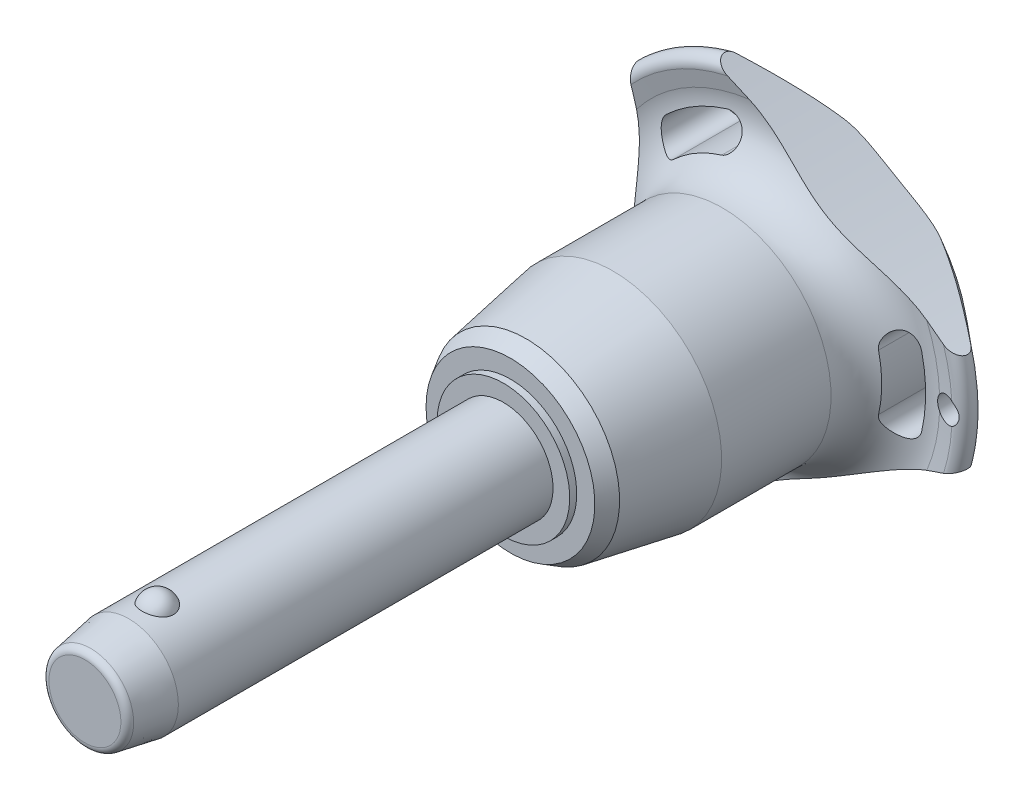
from build123d import *

# Parameters (mm, degrees)
SKETCH1_R           = 6
BOSS_EXTRUDE1_DEPTH = 40
SKETCH2_R           = 5.15
BOSS_EXTRUDE2_DEPTH = 39.7
BOSS_EXTRUDE3_START = 10.6
SKETCH1_2_R         = 6
BOSS_EXTRUDE3_DEPTH = 10.6
CHAMFER1_SIZE       = 5.3
CHAMFER1_SIZE2      = 0.934532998
FILLET1_R           = 0.85
SKETCH6_R           = 144.275
CUT_EXTRUDE1_DEPTH  = 87.518467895
CIRPATTERN1_COUNT   = 3
SKETCH7_R           = 1.5
CUT_EXTRUDE2_DEPTH  = 87.286194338


with BuildPart() as part:
    # Sketch1 → Boss-Extrude1 (new body)
    with BuildSketch(Plane.XY):
        Circle(SKETCH1_R)
    extrude(amount=-BOSS_EXTRUDE1_DEPTH)

    # Sketch2 → Boss-Extrude2 (add)
    with BuildSketch(Plane(origin=(0, 0, -40), x_dir=(-1, 0, 0), z_dir=(0, 0, -1))):
        Circle(SKETCH2_R)
    extrude(amount=BOSS_EXTRUDE2_DEPTH)

    # Sketch3 → Revolve1 (revolve)
    with BuildSketch(Plane(origin=(0, 0, 0), x_dir=(0, 0, -1), z_dir=(1, 0, 0))):
        with BuildLine():
            Line((-1.854049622, 7.25), (-1.854049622, 3.25))
            ThreePointArc((-1.854049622, 3.25), (0.145950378, 5.25), (-1.854049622, 7.25))
        make_face()
        with BuildLine():
            Line((-1.854049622, -3.25), (-1.854049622, -7.25))
            ThreePointArc((-1.854049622, -7.25), (0.145950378, -5.25), (-1.854049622, -3.25))
        make_face()
    revolve(axis=Axis((0, -3.25, 1.854049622), (0, 1, 0)))

    # Sketch1_2 → Boss-Extrude3 (add)
    with BuildSketch(Plane.XY.offset(BOSS_EXTRUDE3_START)):
        Circle(SKETCH1_2_R)
    extrude(amount=-BOSS_EXTRUDE3_DEPTH)

    # Chamfer1
    chamfer1_edges = [part.edges().sort_by_distance(p)[0] for p in [
        (-6, 0, 10.6),
    ]]
    chamfer1_side = [part.faces().sort_by_distance(p)[0] for p in [
        (-6, 0, -14.7),
    ]]
    chamfer(chamfer1_edges, length=CHAMFER1_SIZE, length2=CHAMFER1_SIZE2, reference=chamfer1_side[0])

    # Fillet1
    fillet1_edges = [part.edges().sort_by_distance(p)[0] for p in [
        (-5.065467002, 0, 10.6),
        (5.15, 0, -79.7),
    ]]
    fillet(fillet1_edges, radius=FILLET1_R)

    # Sketch4 → Revolve2 (revolve)
    with BuildSketch(Plane(origin=(0, 0, 0), x_dir=(0, 0, -1), z_dir=(1, 0, 0)), mode=Mode.PRIVATE) as revolve2_sk:
        Polygon((40, 0), (40, 8.017240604), (40.85, 8.017240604), (40.85, 10.206249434), (42.745737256, 11.300753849), (53.233333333, 13.15), (66.466666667, 13.15), (66.466666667, 0), align=None)
    revolve(revolve2_sk.sketch.rotate(Axis((0, 0, -66.466666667), (0, 0, 1)), 90), axis=Axis((0, 0, -66.466666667), (0, 0, 1)))

    # Sketch5 → Revolve3 (revolve)
    with BuildSketch(Plane(origin=(0, 0, 0), x_dir=(0, 0, -1), z_dir=(1, 0, 0)), mode=Mode.PRIVATE) as revolve3_sk:
        with BuildLine():
            Line((72.32877039, 20.428960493), (71.910912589, 22.344207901))
            ThreePointArc((71.910912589, 22.344207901), (72.554394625, 23.677136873), (74.002586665, 23.371345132))
            Line((74.002586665, 23.371345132), (79.141488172, 17.247040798))
            ThreePointArc((79.141488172, 17.247040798), (79.7, 15.584758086), (78.978803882, 13.986322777))
            ThreePointArc((78.978803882, 13.986322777), (74.617427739, 7.589034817), (73.083333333, 0))
            Line((73.083333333, 0), (66.466666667, 0))
            Line((66.466666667, 0), (66.466666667, 13.15))
            ThreePointArc((66.466666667, 13.15), (71.139661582, 15.38660811), (72.32877039, 20.428960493))
        make_face()
    revolve(revolve3_sk.sketch.rotate(Axis((0, 0, -73.083333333), (0, 0, 1)), 90), axis=Axis((0, 0, -73.083333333), (0, 0, 1)))

    # Sketch6 → Cut-Extrude1 (cut, through all)
    with BuildSketch(Plane.XY):
        with Locations((-159.975, 0)):
            Circle(SKETCH6_R)
        with BuildLine():
            ThreePointArc((18.131206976, -4.190753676), (18.60922037, 0), (18.131206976, 4.190753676))
            ThreePointArc((18.131206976, 4.190753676), (15.94840906, 5.553949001), (14.585213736, 3.371151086))
            ThreePointArc((14.585213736, 3.371151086), (14.969740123, 0), (14.585213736, -3.371151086))
            ThreePointArc((14.585213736, -3.371151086), (15.94840906, -5.553949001), (18.131206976, -4.190753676))
        make_face()
    cut_extrude1 = extrude(amount=-CUT_EXTRUDE1_DEPTH, mode=Mode.SUBTRACT)

    # CirPattern1: Cut-Extrude1 ×3 about axis
    cirpattern1_axis = Axis((0, 0, 0), (0, 0, 1))
    for i in range(1, CIRPATTERN1_COUNT):
        add(cut_extrude1.rotate(cirpattern1_axis, i * 360 / CIRPATTERN1_COUNT), mode=Mode.SUBTRACT)

    # Sketch7 → Cut-Extrude2 (cut, through all)
    with BuildSketch(Plane.XY):
        with Locations(Location((21.60922037, 0, 0), (0, 0, 297.620773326))):
            Circle(SKETCH7_R)
    extrude(amount=-CUT_EXTRUDE2_DEPTH, mode=Mode.SUBTRACT)


solid = part.part
